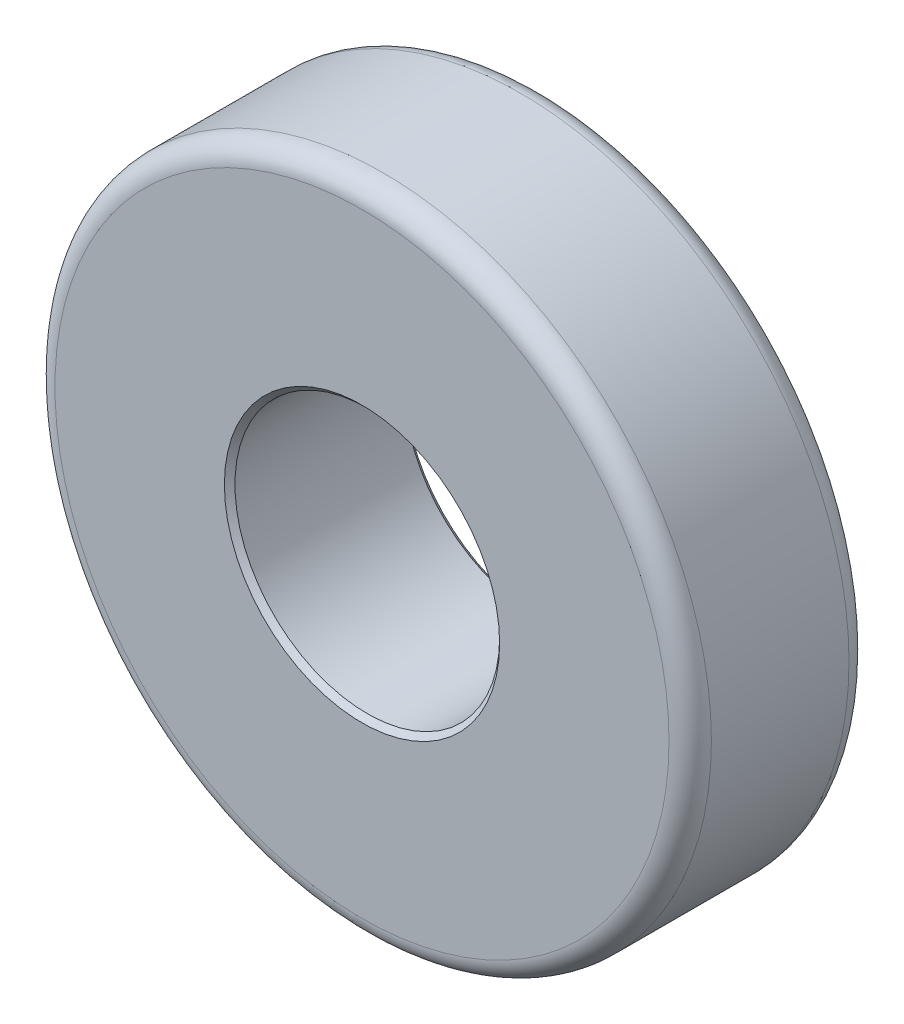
ISO-10303-21;
HEADER;
FILE_DESCRIPTION(('STEP AP214'),'2;1');
FILE_NAME('part.step','',(''),(''),'','','');
FILE_SCHEMA(('AUTOMOTIVE_DESIGN { 1 0 10303 214 1 1 1 1 }'));
ENDSEC;
DATA;
#1=APPLICATION_CONTEXT('core data for automotive mechanical design processes');
#2=APPLICATION_PROTOCOL_DEFINITION('international standard','automotive_design',2000,#1);
#3=PRODUCT_CONTEXT('',#1,'mechanical');
#4=PRODUCT('Part','Part','',(#3));
#5=PRODUCT_RELATED_PRODUCT_CATEGORY('part','',(#4));
#6=PRODUCT_DEFINITION_FORMATION('','',#4);
#7=PRODUCT_DEFINITION_CONTEXT('part definition',#1,'design');
#8=PRODUCT_DEFINITION('design','',#6,#7);
#9=PRODUCT_DEFINITION_SHAPE('','',#8);
#10=(LENGTH_UNIT() NAMED_UNIT(*) SI_UNIT(.MILLI.,.METRE.));
#11=(NAMED_UNIT(*) PLANE_ANGLE_UNIT() SI_UNIT($,.RADIAN.));
#12=(NAMED_UNIT(*) SI_UNIT($,.STERADIAN.) SOLID_ANGLE_UNIT());
#13=UNCERTAINTY_MEASURE_WITH_UNIT(LENGTH_MEASURE(1.E-05),#10,'distance_accuracy_value','');
#14=(GEOMETRIC_REPRESENTATION_CONTEXT(3) GLOBAL_UNCERTAINTY_ASSIGNED_CONTEXT((#13)) GLOBAL_UNIT_ASSIGNED_CONTEXT((#10,
#11,#12)) REPRESENTATION_CONTEXT('',''));
#15=CARTESIAN_POINT('',(0.,0.,0.));
#16=DIRECTION('',(0.,0.,1.));
#17=DIRECTION('',(1.,0.,0.));
#18=AXIS2_PLACEMENT_3D('',#15,#16,#17);
#19=CARTESIAN_POINT('',(0.,0.,17.));
#20=DIRECTION('',(0.,0.,1.));
#21=DIRECTION('',(1.,0.,0.));
#22=AXIS2_PLACEMENT_3D('',#19,#20,#21);
#23=PLANE('',#22);
#24=CARTESIAN_POINT('',(0.,0.,17.));
#25=DIRECTION('',(0.,0.,1.));
#26=DIRECTION('',(1.,0.,0.));
#27=AXIS2_PLACEMENT_3D('',#24,#25,#26);
#28=CIRCLE('',#27,13.);
#29=CARTESIAN_POINT('',(13.,0.,17.));
#30=VERTEX_POINT('',#29);
#31=EDGE_CURVE('E10',#30,#30,#28,.F.);
#32=ORIENTED_EDGE('',*,*,#31,.T.);
#33=EDGE_LOOP('',(#32));
#34=FACE_BOUND('',#33,.T.);
#35=CARTESIAN_POINT('',(0.,0.,17.));
#36=DIRECTION('',(0.,0.,1.));
#37=DIRECTION('',(1.,0.,0.));
#38=AXIS2_PLACEMENT_3D('',#35,#36,#37);
#39=CIRCLE('',#38,29.);
#40=CARTESIAN_POINT('',(29.,0.,17.));
#41=VERTEX_POINT('',#40);
#42=EDGE_CURVE('E50',#41,#41,#39,.T.);
#43=ORIENTED_EDGE('',*,*,#42,.T.);
#44=EDGE_LOOP('',(#43));
#45=FACE_BOUND('',#44,.T.);
#46=ADVANCED_FACE('F30',(#34,#45),#23,.T.);
#47=CARTESIAN_POINT('',(0.,0.,0.));
#48=DIRECTION('',(0.,0.,1.));
#49=DIRECTION('',(1.,0.,0.));
#50=AXIS2_PLACEMENT_3D('',#47,#48,#49);
#51=PLANE('',#50);
#52=CARTESIAN_POINT('',(0.,0.,0.));
#53=DIRECTION('',(0.,0.,1.));
#54=DIRECTION('',(1.,0.,0.));
#55=AXIS2_PLACEMENT_3D('',#52,#53,#54);
#56=CIRCLE('',#55,13.);
#57=CARTESIAN_POINT('',(13.,0.,0.));
#58=VERTEX_POINT('',#57);
#59=EDGE_CURVE('E45',#58,#58,#56,.T.);
#60=ORIENTED_EDGE('',*,*,#59,.T.);
#61=EDGE_LOOP('',(#60));
#62=FACE_BOUND('',#61,.T.);
#63=CARTESIAN_POINT('',(0.,0.,0.));
#64=DIRECTION('',(0.,0.,1.));
#65=DIRECTION('',(1.,0.,0.));
#66=AXIS2_PLACEMENT_3D('',#63,#64,#65);
#67=CIRCLE('',#66,29.);
#68=CARTESIAN_POINT('',(29.,0.,0.));
#69=VERTEX_POINT('',#68);
#70=EDGE_CURVE('E53',#69,#69,#67,.F.);
#71=ORIENTED_EDGE('',*,*,#70,.T.);
#72=EDGE_LOOP('',(#71));
#73=FACE_BOUND('',#72,.T.);
#74=ADVANCED_FACE('F74',(#62,#73),#51,.F.);
#75=CARTESIAN_POINT('',(0.,0.,17.));
#76=DIRECTION('',(0.,0.,-1.));
#77=DIRECTION('',(-1.,0.,0.));
#78=AXIS2_PLACEMENT_3D('',#75,#76,#77);
#79=CYLINDRICAL_SURFACE('',#78,31.);
#80=CARTESIAN_POINT('',(0.,0.,2.));
#81=DIRECTION('',(0.,0.,1.));
#82=DIRECTION('',(1.,0.,0.));
#83=AXIS2_PLACEMENT_3D('',#80,#81,#82);
#84=CIRCLE('',#83,31.);
#85=CARTESIAN_POINT('',(31.,0.,2.));
#86=VERTEX_POINT('',#85);
#87=EDGE_CURVE('E56',#86,#86,#84,.T.);
#88=ORIENTED_EDGE('',*,*,#87,.T.);
#89=EDGE_LOOP('',(#88));
#90=FACE_BOUND('',#89,.T.);
#91=CARTESIAN_POINT('',(0.,0.,15.));
#92=DIRECTION('',(0.,0.,1.));
#93=DIRECTION('',(1.,0.,0.));
#94=AXIS2_PLACEMENT_3D('',#91,#92,#93);
#95=CIRCLE('',#94,31.);
#96=CARTESIAN_POINT('',(31.,0.,15.));
#97=VERTEX_POINT('',#96);
#98=EDGE_CURVE('E59',#97,#97,#95,.F.);
#99=ORIENTED_EDGE('',*,*,#98,.T.);
#100=EDGE_LOOP('',(#99));
#101=FACE_BOUND('',#100,.T.);
#102=ADVANCED_FACE('F63',(#90,#101),#79,.T.);
#103=CARTESIAN_POINT('',(0.,0.,17.));
#104=DIRECTION('',(0.,0.,-1.));
#105=DIRECTION('',(-1.,0.,0.));
#106=AXIS2_PLACEMENT_3D('',#103,#104,#105);
#107=CYLINDRICAL_SURFACE('',#106,12.5);
#108=CARTESIAN_POINT('',(0.,0.,0.500000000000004));
#109=DIRECTION('',(0.,0.,1.));
#110=DIRECTION('',(1.,0.,0.));
#111=AXIS2_PLACEMENT_3D('',#108,#109,#110);
#112=CIRCLE('',#111,12.5);
#113=CARTESIAN_POINT('',(12.5,0.,0.500000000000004));
#114=VERTEX_POINT('',#113);
#115=EDGE_CURVE('E37',#114,#114,#112,.F.);
#116=ORIENTED_EDGE('',*,*,#115,.T.);
#117=EDGE_LOOP('',(#116));
#118=FACE_BOUND('',#117,.T.);
#119=CARTESIAN_POINT('',(0.,0.,16.5));
#120=DIRECTION('',(0.,0.,1.));
#121=DIRECTION('',(1.,0.,0.));
#122=AXIS2_PLACEMENT_3D('',#119,#120,#121);
#123=CIRCLE('',#122,12.5);
#124=CARTESIAN_POINT('',(12.5,0.,16.5));
#125=VERTEX_POINT('',#124);
#126=EDGE_CURVE('E41',#125,#125,#123,.T.);
#127=ORIENTED_EDGE('',*,*,#126,.T.);
#128=EDGE_LOOP('',(#127));
#129=FACE_BOUND('',#128,.T.);
#130=ADVANCED_FACE('F82',(#118,#129),#107,.F.);
#131=CARTESIAN_POINT('',(0.,0.,2.));
#132=DIRECTION('',(0.,0.,1.));
#133=DIRECTION('',(1.,0.,0.));
#134=AXIS2_PLACEMENT_3D('',#131,#132,#133);
#135=TOROIDAL_SURFACE('',#134,29.,2.);
#136=ORIENTED_EDGE('',*,*,#70,.F.);
#137=EDGE_LOOP('',(#136));
#138=FACE_BOUND('',#137,.T.);
#139=ORIENTED_EDGE('',*,*,#87,.F.);
#140=EDGE_LOOP('',(#139));
#141=FACE_BOUND('',#140,.T.);
#142=ADVANCED_FACE('F69',(#138,#141),#135,.T.);
#143=CARTESIAN_POINT('',(0.,0.,15.));
#144=DIRECTION('',(0.,0.,1.));
#145=DIRECTION('',(1.,0.,0.));
#146=AXIS2_PLACEMENT_3D('',#143,#144,#145);
#147=TOROIDAL_SURFACE('',#146,29.,2.);
#148=ORIENTED_EDGE('',*,*,#98,.F.);
#149=EDGE_LOOP('',(#148));
#150=FACE_BOUND('',#149,.T.);
#151=ORIENTED_EDGE('',*,*,#42,.F.);
#152=EDGE_LOOP('',(#151));
#153=FACE_BOUND('',#152,.T.);
#154=ADVANCED_FACE('F65',(#150,#153),#147,.T.);
#155=CARTESIAN_POINT('',(0.,0.,0.));
#156=DIRECTION('',(0.,0.,-1.));
#157=DIRECTION('',(-1.,0.,0.));
#158=AXIS2_PLACEMENT_3D('',#155,#156,#157);
#159=CONICAL_SURFACE('',#158,13.,0.785398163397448);
#160=ORIENTED_EDGE('',*,*,#115,.F.);
#161=EDGE_LOOP('',(#160));
#162=FACE_BOUND('',#161,.T.);
#163=ORIENTED_EDGE('',*,*,#59,.F.);
#164=EDGE_LOOP('',(#163));
#165=FACE_BOUND('',#164,.T.);
#166=ADVANCED_FACE('F68',(#162,#165),#159,.F.);
#167=CARTESIAN_POINT('',(0.,0.,16.5));
#168=DIRECTION('',(0.,0.,1.));
#169=DIRECTION('',(1.,0.,0.));
#170=AXIS2_PLACEMENT_3D('',#167,#168,#169);
#171=CONICAL_SURFACE('',#170,12.5,0.785398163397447);
#172=ORIENTED_EDGE('',*,*,#31,.F.);
#173=EDGE_LOOP('',(#172));
#174=FACE_BOUND('',#173,.T.);
#175=ORIENTED_EDGE('',*,*,#126,.F.);
#176=EDGE_LOOP('',(#175));
#177=FACE_BOUND('',#176,.T.);
#178=ADVANCED_FACE('F32',(#174,#177),#171,.F.);
#179=CLOSED_SHELL('',(#46,#74,#102,#130,#142,#154,#166,#178));
#180=MANIFOLD_SOLID_BREP('B2',#179);
#181=ADVANCED_BREP_SHAPE_REPRESENTATION('',(#18,#180),#14);
#182=SHAPE_DEFINITION_REPRESENTATION(#9,#181);
ENDSEC;
END-ISO-10303-21;
